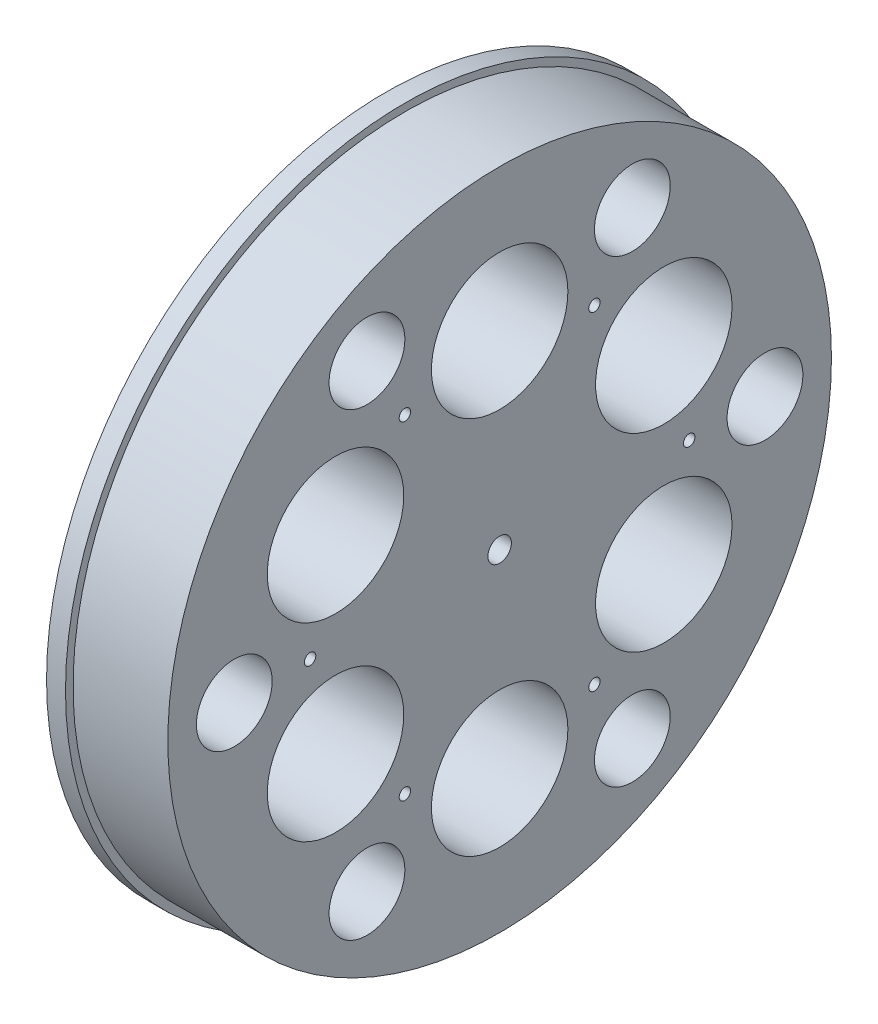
from build123d import *

# Parameters (mm, degrees)
ESQUISSE1_R             = 89.535
ESQUISSE1_R_2           = 18
ESQUISSE1_R_3           = 10
ESQUISSE1_R_4           = 1.5
ESQUISSE1_R_5           = 3.1
BOSS_EXTRU_1_DEPTH      = 30
ESQUISSE2_R             = 92.159796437
ESQUISSE2_R_2           = 87.535
ENL_V_MAT_EXTRU_1_DEPTH = 25


with BuildPart() as part:
    # Esquisse1 → Boss.-Extru.1 (new body)
    with BuildSketch(Plane(origin=(0, 0, 0), x_dir=(0, 0, -1), z_dir=(1, 0, 0))):
        with Locations((290, 0)):
            Circle(ESQUISSE1_R)
        with Locations((290, 50)):
            Circle(ESQUISSE1_R_2, mode=Mode.SUBTRACT)
        with Locations((220, 0)):
            Circle(ESQUISSE1_R_3, mode=Mode.SUBTRACT)
        with Locations((255, 60.621778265)):
            Circle(ESQUISSE1_R_3, mode=Mode.SUBTRACT)
        with Locations((325, 60.621778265)):
            Circle(ESQUISSE1_R_3, mode=Mode.SUBTRACT)
        with Locations((240, 0)):
            Circle(ESQUISSE1_R_4, mode=Mode.SUBTRACT)
        with Locations((290, 0)):
            Circle(ESQUISSE1_R_5, mode=Mode.SUBTRACT)
        with Locations((360, 0)):
            Circle(ESQUISSE1_R_3, mode=Mode.SUBTRACT)
        with Locations((325, -60.621778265)):
            Circle(ESQUISSE1_R_3, mode=Mode.SUBTRACT)
        with Locations((255, -60.621778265)):
            Circle(ESQUISSE1_R_3, mode=Mode.SUBTRACT)
        with Locations((333.301270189, 25)):
            Circle(ESQUISSE1_R_2, mode=Mode.SUBTRACT)
        with Locations((265, 43.301270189)):
            Circle(ESQUISSE1_R_4, mode=Mode.SUBTRACT)
        with Locations((333.301270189, -25)):
            Circle(ESQUISSE1_R_2, mode=Mode.SUBTRACT)
        with Locations((315, 43.301270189)):
            Circle(ESQUISSE1_R_4, mode=Mode.SUBTRACT)
        with Locations((290, -50)):
            Circle(ESQUISSE1_R_2, mode=Mode.SUBTRACT)
        with Locations((340, 0)):
            Circle(ESQUISSE1_R_4, mode=Mode.SUBTRACT)
        with Locations((246.698729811, -25)):
            Circle(ESQUISSE1_R_2, mode=Mode.SUBTRACT)
        with Locations((315, -43.301270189)):
            Circle(ESQUISSE1_R_4, mode=Mode.SUBTRACT)
        with Locations((246.698729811, 25)):
            Circle(ESQUISSE1_R_2, mode=Mode.SUBTRACT)
        with Locations((265, -43.301270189)):
            Circle(ESQUISSE1_R_4, mode=Mode.SUBTRACT)
    extrude(amount=BOSS_EXTRU_1_DEPTH)

    # Esquisse2 → Enl_v. mat.-Extru.1 (cut)
    with BuildSketch(Plane(origin=(30, 0, 0), x_dir=(0, 0, -1), z_dir=(1, 0, 0))):
        with Locations((290, 0)):
            Circle(ESQUISSE2_R)
        with Locations((290, 0)):
            Circle(ESQUISSE2_R_2, mode=Mode.SUBTRACT)
    extrude(amount=-ENL_V_MAT_EXTRU_1_DEPTH, mode=Mode.SUBTRACT)


solid = part.part
